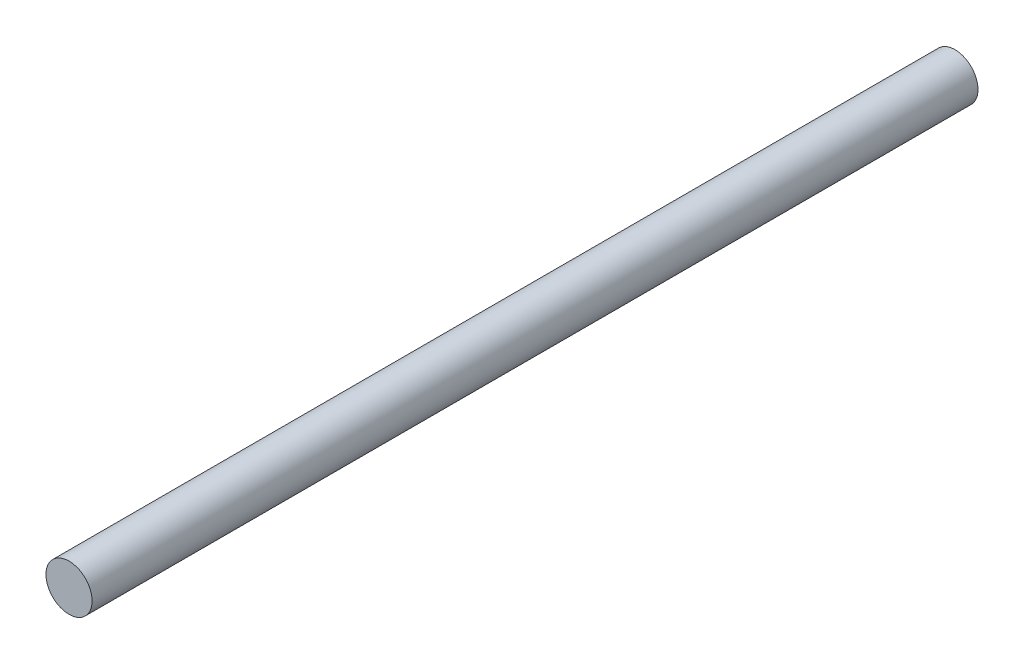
ISO-10303-21;
HEADER;
FILE_DESCRIPTION(('STEP AP214'),'2;1');
FILE_NAME('part.step','',(''),(''),'','','');
FILE_SCHEMA(('AUTOMOTIVE_DESIGN { 1 0 10303 214 1 1 1 1 }'));
ENDSEC;
DATA;
#1=APPLICATION_CONTEXT('core data for automotive mechanical design processes');
#2=APPLICATION_PROTOCOL_DEFINITION('international standard','automotive_design',2000,#1);
#3=PRODUCT_CONTEXT('',#1,'mechanical');
#4=PRODUCT('Part','Part','',(#3));
#5=PRODUCT_RELATED_PRODUCT_CATEGORY('part','',(#4));
#6=PRODUCT_DEFINITION_FORMATION('','',#4);
#7=PRODUCT_DEFINITION_CONTEXT('part definition',#1,'design');
#8=PRODUCT_DEFINITION('design','',#6,#7);
#9=PRODUCT_DEFINITION_SHAPE('','',#8);
#10=(LENGTH_UNIT() NAMED_UNIT(*) SI_UNIT(.MILLI.,.METRE.));
#11=(NAMED_UNIT(*) PLANE_ANGLE_UNIT() SI_UNIT($,.RADIAN.));
#12=(NAMED_UNIT(*) SI_UNIT($,.STERADIAN.) SOLID_ANGLE_UNIT());
#13=UNCERTAINTY_MEASURE_WITH_UNIT(LENGTH_MEASURE(1.E-05),#10,'distance_accuracy_value','');
#14=(GEOMETRIC_REPRESENTATION_CONTEXT(3) GLOBAL_UNCERTAINTY_ASSIGNED_CONTEXT((#13)) GLOBAL_UNIT_ASSIGNED_CONTEXT((#10,
#11,#12)) REPRESENTATION_CONTEXT('',''));
#15=CARTESIAN_POINT('',(0.,0.,0.));
#16=DIRECTION('',(0.,0.,1.));
#17=DIRECTION('',(1.,0.,0.));
#18=AXIS2_PLACEMENT_3D('',#15,#16,#17);
#19=CARTESIAN_POINT('',(0.,0.,96.));
#20=DIRECTION('',(0.,0.,-1.));
#21=DIRECTION('',(-1.,0.,0.));
#22=AXIS2_PLACEMENT_3D('',#19,#20,#21);
#23=CYLINDRICAL_SURFACE('',#22,2.5);
#24=CARTESIAN_POINT('',(0.,0.,96.));
#25=DIRECTION('',(0.,0.,1.));
#26=DIRECTION('',(1.,0.,0.));
#27=AXIS2_PLACEMENT_3D('',#24,#25,#26);
#28=CIRCLE('',#27,2.5);
#29=CARTESIAN_POINT('',(2.5,0.,96.));
#30=VERTEX_POINT('',#29);
#31=EDGE_CURVE('E10',#30,#30,#28,.T.);
#32=ORIENTED_EDGE('',*,*,#31,.F.);
#33=EDGE_LOOP('',(#32));
#34=FACE_BOUND('',#33,.T.);
#35=CARTESIAN_POINT('',(0.,0.,0.));
#36=DIRECTION('',(0.,0.,1.));
#37=DIRECTION('',(1.,0.,0.));
#38=AXIS2_PLACEMENT_3D('',#35,#36,#37);
#39=CIRCLE('',#38,2.5);
#40=CARTESIAN_POINT('',(2.5,0.,0.));
#41=VERTEX_POINT('',#40);
#42=EDGE_CURVE('E39',#41,#41,#39,.T.);
#43=ORIENTED_EDGE('',*,*,#42,.T.);
#44=EDGE_LOOP('',(#43));
#45=FACE_BOUND('',#44,.T.);
#46=ADVANCED_FACE('F33',(#34,#45),#23,.T.);
#47=CARTESIAN_POINT('',(0.,0.,96.));
#48=DIRECTION('',(0.,0.,1.));
#49=DIRECTION('',(1.,0.,0.));
#50=AXIS2_PLACEMENT_3D('',#47,#48,#49);
#51=PLANE('',#50);
#52=ORIENTED_EDGE('',*,*,#31,.T.);
#53=EDGE_LOOP('',(#52));
#54=FACE_BOUND('',#53,.T.);
#55=ADVANCED_FACE('F48',(#54),#51,.T.);
#56=CARTESIAN_POINT('',(0.,0.,0.));
#57=DIRECTION('',(0.,0.,1.));
#58=DIRECTION('',(1.,0.,0.));
#59=AXIS2_PLACEMENT_3D('',#56,#57,#58);
#60=PLANE('',#59);
#61=ORIENTED_EDGE('',*,*,#42,.F.);
#62=EDGE_LOOP('',(#61));
#63=FACE_BOUND('',#62,.T.);
#64=ADVANCED_FACE('F46',(#63),#60,.F.);
#65=CLOSED_SHELL('',(#46,#55,#64));
#66=MANIFOLD_SOLID_BREP('B2',#65);
#67=ADVANCED_BREP_SHAPE_REPRESENTATION('',(#18,#66),#14);
#68=SHAPE_DEFINITION_REPRESENTATION(#9,#67);
ENDSEC;
END-ISO-10303-21;
